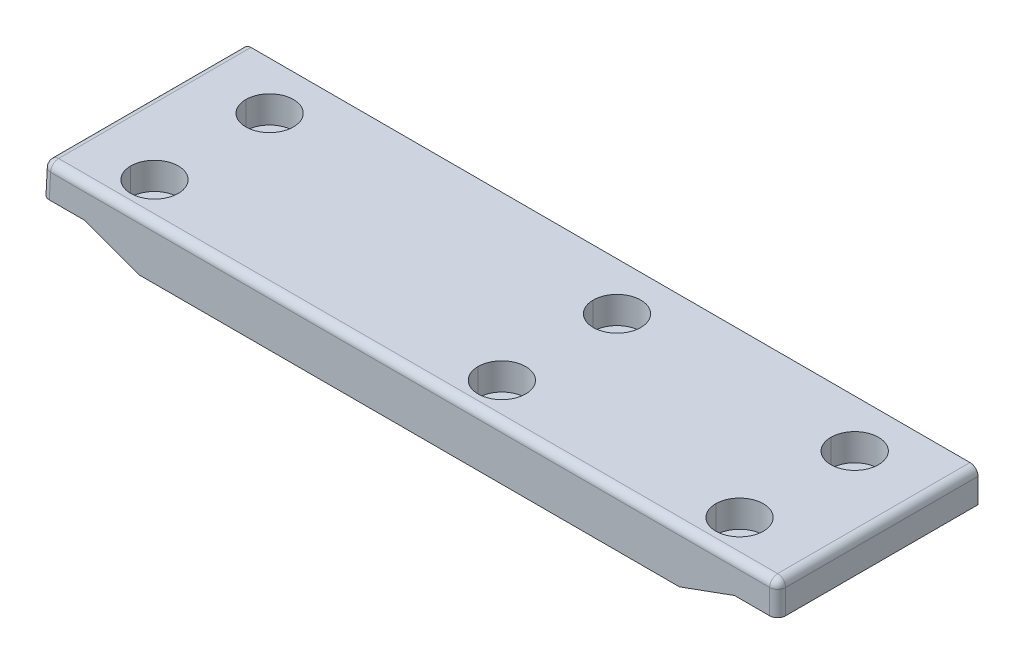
ISO-10303-21;
HEADER;
FILE_DESCRIPTION(('STEP AP214'),'2;1');
FILE_NAME('part.step','',(''),(''),'','','');
FILE_SCHEMA(('AUTOMOTIVE_DESIGN { 1 0 10303 214 1 1 1 1 }'));
ENDSEC;
DATA;
#1=APPLICATION_CONTEXT('core data for automotive mechanical design processes');
#2=APPLICATION_PROTOCOL_DEFINITION('international standard','automotive_design',2000,#1);
#3=PRODUCT_CONTEXT('',#1,'mechanical');
#4=PRODUCT('Part','Part','',(#3));
#5=PRODUCT_RELATED_PRODUCT_CATEGORY('part','',(#4));
#6=PRODUCT_DEFINITION_FORMATION('','',#4);
#7=PRODUCT_DEFINITION_CONTEXT('part definition',#1,'design');
#8=PRODUCT_DEFINITION('design','',#6,#7);
#9=PRODUCT_DEFINITION_SHAPE('','',#8);
#10=(LENGTH_UNIT() NAMED_UNIT(*) SI_UNIT(.MILLI.,.METRE.));
#11=(NAMED_UNIT(*) PLANE_ANGLE_UNIT() SI_UNIT($,.RADIAN.));
#12=(NAMED_UNIT(*) SI_UNIT($,.STERADIAN.) SOLID_ANGLE_UNIT());
#13=UNCERTAINTY_MEASURE_WITH_UNIT(LENGTH_MEASURE(1.E-05),#10,'distance_accuracy_value','');
#14=(GEOMETRIC_REPRESENTATION_CONTEXT(3) GLOBAL_UNCERTAINTY_ASSIGNED_CONTEXT((#13)) GLOBAL_UNIT_ASSIGNED_CONTEXT((#10,
#11,#12)) REPRESENTATION_CONTEXT('',''));
#15=CARTESIAN_POINT('',(0.,0.,0.));
#16=DIRECTION('',(0.,0.,1.));
#17=DIRECTION('',(1.,0.,0.));
#18=AXIS2_PLACEMENT_3D('',#15,#16,#17);
#19=CARTESIAN_POINT('',(2.68106962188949,72.0861397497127,38.4));
#20=DIRECTION('',(-0.0523359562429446,-0.998629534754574,0.));
#21=DIRECTION('',(0.998629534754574,-0.0523359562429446,0.));
#22=AXIS2_PLACEMENT_3D('',#19,#20,#21);
#23=CYLINDRICAL_SURFACE('',#22,1.6);
#24=CARTESIAN_POINT('',(1.8589938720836,56.4,38.4));
#25=DIRECTION('',(-0.0523359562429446,-0.998629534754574,0.));
#26=DIRECTION('',(-0.998629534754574,0.0523359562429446,0.));
#27=AXIS2_PLACEMENT_3D('',#24,#25,#26);
#28=CIRCLE('',#27,1.6);
#29=CARTESIAN_POINT('',(1.8589938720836,56.4,40.));
#30=VERTEX_POINT('',#29);
#31=CARTESIAN_POINT('',(0.261186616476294,56.4837375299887,38.4));
#32=VERTEX_POINT('',#31);
#33=EDGE_CURVE('E11',#30,#32,#28,.T.);
#34=ORIENTED_EDGE('',*,*,#33,.T.);
#35=DIRECTION('',(0.0523359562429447,0.998629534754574,0.));
#36=VECTOR('',#35,1.);
#37=CARTESIAN_POINT('',(0.,51.5,38.4));
#38=LINE('',#37,#36);
#39=CARTESIAN_POINT('',(0.,51.5,38.4));
#40=VERTEX_POINT('',#39);
#41=EDGE_CURVE('E288',#40,#32,#38,.T.);
#42=ORIENTED_EDGE('',*,*,#41,.F.);
#43=CARTESIAN_POINT('',(1.60219575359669,51.5,40.));
#44=CARTESIAN_POINT('',(0.663651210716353,51.5,40.));
#45=CARTESIAN_POINT('',(0.,51.5,39.3372583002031));
#46=CARTESIAN_POINT('',(0.,51.5,38.4));
#47=(BOUNDED_CURVE() B_SPLINE_CURVE(3,(#43,#44,#45,#46),.UNSPECIFIED.,.F.,
.F.) B_SPLINE_CURVE_WITH_KNOTS((4,4),(4.7123889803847,6.28318530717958),
.UNSPECIFIED.) CURVE() GEOMETRIC_REPRESENTATION_ITEM() RATIONAL_B_SPLINE_CURVE((1.,
0.804737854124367,0.804737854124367,1.)) REPRESENTATION_ITEM(''));
#48=CARTESIAN_POINT('',(1.60219575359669,51.5,40.));
#49=VERTEX_POINT('',#48);
#50=EDGE_CURVE('E148',#49,#40,#47,.T.);
#51=ORIENTED_EDGE('',*,*,#50,.F.);
#52=DIRECTION('',(-0.0523359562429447,-0.998629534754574,0.));
#53=VECTOR('',#52,1.);
#54=CARTESIAN_POINT('',(2.68106962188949,72.0861397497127,40.));
#55=LINE('',#54,#53);
#56=EDGE_CURVE('E282',#30,#49,#55,.T.);
#57=ORIENTED_EDGE('',*,*,#56,.F.);
#58=EDGE_LOOP('',(#34,#42,#51,#57));
#59=FACE_BOUND('',#58,.T.);
#60=ADVANCED_FACE('F16',(#59),#23,.T.);
#61=CARTESIAN_POINT('',(1.8589938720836,56.4,38.4));
#62=DIRECTION('',(0.,0.,1.));
#63=DIRECTION('',(1.,0.,0.));
#64=AXIS2_PLACEMENT_3D('',#61,#62,#63);
#65=SPHERICAL_SURFACE('',#64,1.6);
#66=CARTESIAN_POINT('',(1.8589938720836,56.4,38.4));
#67=DIRECTION('',(-1.,0.,0.));
#68=DIRECTION('',(0.,-1.,0.));
#69=AXIS2_PLACEMENT_3D('',#66,#67,#68);
#70=CIRCLE('',#69,1.6);
#71=CARTESIAN_POINT('',(1.85899387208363,58.,38.4));
#72=VERTEX_POINT('',#71);
#73=EDGE_CURVE('E25',#30,#72,#70,.T.);
#74=ORIENTED_EDGE('',*,*,#73,.T.);
#75=CARTESIAN_POINT('',(1.85899387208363,56.4,38.4));
#76=DIRECTION('',(0.,0.,1.));
#77=DIRECTION('',(0.,-1.,0.));
#78=AXIS2_PLACEMENT_3D('',#75,#76,#77);
#79=CIRCLE('',#78,1.6);
#80=EDGE_CURVE('E439',#72,#32,#79,.T.);
#81=ORIENTED_EDGE('',*,*,#80,.T.);
#82=ORIENTED_EDGE('',*,*,#33,.F.);
#83=EDGE_LOOP('',(#74,#81,#82));
#84=FACE_BOUND('',#83,.T.);
#85=ADVANCED_FACE('F832',(#84),#65,.T.);
#86=CARTESIAN_POINT('',(80.6492607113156,56.4,38.4));
#87=DIRECTION('',(-1.,0.,0.));
#88=DIRECTION('',(0.,-1.,0.));
#89=AXIS2_PLACEMENT_3D('',#86,#87,#88);
#90=CYLINDRICAL_SURFACE('',#89,1.6);
#91=CARTESIAN_POINT('',(145.4,56.4,38.4));
#92=DIRECTION('',(-1.,0.,0.));
#93=DIRECTION('',(0.,1.,0.));
#94=AXIS2_PLACEMENT_3D('',#91,#92,#93);
#95=CIRCLE('',#94,1.6);
#96=CARTESIAN_POINT('',(145.4,56.4,40.));
#97=VERTEX_POINT('',#96);
#98=CARTESIAN_POINT('',(145.4,58.,38.4));
#99=VERTEX_POINT('',#98);
#100=EDGE_CURVE('E19',#97,#99,#95,.T.);
#101=ORIENTED_EDGE('',*,*,#100,.T.);
#102=DIRECTION('',(1.,0.,0.));
#103=VECTOR('',#102,1.);
#104=CARTESIAN_POINT('',(147.,58.,38.4));
#105=LINE('',#104,#103);
#106=EDGE_CURVE('E302',#72,#99,#105,.T.);
#107=ORIENTED_EDGE('',*,*,#106,.F.);
#108=ORIENTED_EDGE('',*,*,#73,.F.);
#109=DIRECTION('',(-1.,0.,0.));
#110=VECTOR('',#109,1.);
#111=CARTESIAN_POINT('',(80.6492607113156,56.4,40.));
#112=LINE('',#111,#110);
#113=EDGE_CURVE('E189',#97,#30,#112,.T.);
#114=ORIENTED_EDGE('',*,*,#113,.F.);
#115=EDGE_LOOP('',(#101,#107,#108,#114));
#116=FACE_BOUND('',#115,.T.);
#117=ADVANCED_FACE('F837',(#116),#90,.T.);
#118=CARTESIAN_POINT('',(1.85899387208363,56.4,0.));
#119=DIRECTION('',(0.,0.,1.));
#120=DIRECTION('',(0.,-1.,0.));
#121=AXIS2_PLACEMENT_3D('',#118,#119,#120);
#122=CYLINDRICAL_SURFACE('',#121,1.6);
#123=CARTESIAN_POINT('',(1.85899387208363,56.4,0.));
#124=DIRECTION('',(0.,0.,-1.));
#125=DIRECTION('',(0.,-1.,0.));
#126=AXIS2_PLACEMENT_3D('',#123,#124,#125);
#127=CIRCLE('',#126,1.6);
#128=CARTESIAN_POINT('',(0.261186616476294,56.4837375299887,0.));
#129=VERTEX_POINT('',#128);
#130=CARTESIAN_POINT('',(1.8589938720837,58.,0.));
#131=VERTEX_POINT('',#130);
#132=EDGE_CURVE('E186',#129,#131,#127,.T.);
#133=ORIENTED_EDGE('',*,*,#132,.F.);
#134=DIRECTION('',(0.,0.,-1.));
#135=VECTOR('',#134,1.);
#136=CARTESIAN_POINT('',(0.261186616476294,56.4837375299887,0.));
#137=LINE('',#136,#135);
#138=EDGE_CURVE('E292',#32,#129,#137,.T.);
#139=ORIENTED_EDGE('',*,*,#138,.F.);
#140=ORIENTED_EDGE('',*,*,#80,.F.);
#141=DIRECTION('',(0.,0.,1.));
#142=VECTOR('',#141,1.);
#143=CARTESIAN_POINT('',(1.85899387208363,58.,0.));
#144=LINE('',#143,#142);
#145=EDGE_CURVE('E326',#131,#72,#144,.T.);
#146=ORIENTED_EDGE('',*,*,#145,.F.);
#147=EDGE_LOOP('',(#133,#139,#140,#146));
#148=FACE_BOUND('',#147,.T.);
#149=ADVANCED_FACE('F845',(#148),#122,.T.);
#150=CARTESIAN_POINT('',(145.4,56.4,38.4));
#151=DIRECTION('',(0.,0.,1.));
#152=DIRECTION('',(1.,0.,0.));
#153=AXIS2_PLACEMENT_3D('',#150,#151,#152);
#154=SPHERICAL_SURFACE('',#153,1.6);
#155=CARTESIAN_POINT('',(145.4,56.4,38.4));
#156=DIRECTION('',(0.,1.,0.));
#157=DIRECTION('',(-1.,0.,0.));
#158=AXIS2_PLACEMENT_3D('',#155,#156,#157);
#159=CIRCLE('',#158,1.6);
#160=CARTESIAN_POINT('',(147.,56.4,38.4));
#161=VERTEX_POINT('',#160);
#162=EDGE_CURVE('E231',#97,#161,#159,.T.);
#163=ORIENTED_EDGE('',*,*,#162,.T.);
#164=CARTESIAN_POINT('',(145.4,56.4,38.4));
#165=DIRECTION('',(0.,0.,1.));
#166=DIRECTION('',(0.,-1.,0.));
#167=AXIS2_PLACEMENT_3D('',#164,#165,#166);
#168=CIRCLE('',#167,1.6);
#169=EDGE_CURVE('E175',#161,#99,#168,.T.);
#170=ORIENTED_EDGE('',*,*,#169,.T.);
#171=ORIENTED_EDGE('',*,*,#100,.F.);
#172=EDGE_LOOP('',(#163,#170,#171));
#173=FACE_BOUND('',#172,.T.);
#174=ADVANCED_FACE('F939',(#173),#154,.T.);
#175=CARTESIAN_POINT('',(145.4,68.,38.4));
#176=DIRECTION('',(0.,1.,0.));
#177=DIRECTION('',(-1.,0.,0.));
#178=AXIS2_PLACEMENT_3D('',#175,#176,#177);
#179=CYLINDRICAL_SURFACE('',#178,1.6);
#180=CARTESIAN_POINT('',(145.4,51.5,38.4));
#181=DIRECTION('',(0.,-1.,0.));
#182=DIRECTION('',(1.,0.,0.));
#183=AXIS2_PLACEMENT_3D('',#180,#181,#182);
#184=CIRCLE('',#183,1.6);
#185=CARTESIAN_POINT('',(147.,51.5,38.4));
#186=VERTEX_POINT('',#185);
#187=CARTESIAN_POINT('',(145.4,51.5,40.));
#188=VERTEX_POINT('',#187);
#189=EDGE_CURVE('E313',#186,#188,#184,.T.);
#190=ORIENTED_EDGE('',*,*,#189,.F.);
#191=DIRECTION('',(0.,-1.,0.));
#192=VECTOR('',#191,1.);
#193=CARTESIAN_POINT('',(147.,51.5,38.4));
#194=LINE('',#193,#192);
#195=EDGE_CURVE('E350',#161,#186,#194,.T.);
#196=ORIENTED_EDGE('',*,*,#195,.F.);
#197=ORIENTED_EDGE('',*,*,#162,.F.);
#198=DIRECTION('',(0.,1.,0.));
#199=VECTOR('',#198,1.);
#200=CARTESIAN_POINT('',(145.4,68.,40.));
#201=LINE('',#200,#199);
#202=EDGE_CURVE('E277',#188,#97,#201,.T.);
#203=ORIENTED_EDGE('',*,*,#202,.F.);
#204=EDGE_LOOP('',(#190,#196,#197,#203));
#205=FACE_BOUND('',#204,.T.);
#206=ADVANCED_FACE('F936',(#205),#179,.T.);
#207=CARTESIAN_POINT('',(145.4,56.4,0.));
#208=DIRECTION('',(0.,0.,1.));
#209=DIRECTION('',(0.,-1.,0.));
#210=AXIS2_PLACEMENT_3D('',#207,#208,#209);
#211=CYLINDRICAL_SURFACE('',#210,1.6);
#212=CARTESIAN_POINT('',(145.4,56.4,0.));
#213=DIRECTION('',(0.,0.,-1.));
#214=DIRECTION('',(0.,-1.,0.));
#215=AXIS2_PLACEMENT_3D('',#212,#213,#214);
#216=CIRCLE('',#215,1.6);
#217=CARTESIAN_POINT('',(145.4,58.,0.));
#218=VERTEX_POINT('',#217);
#219=CARTESIAN_POINT('',(147.,56.4,0.));
#220=VERTEX_POINT('',#219);
#221=EDGE_CURVE('E147',#218,#220,#216,.T.);
#222=ORIENTED_EDGE('',*,*,#221,.F.);
#223=DIRECTION('',(0.,0.,-1.));
#224=VECTOR('',#223,1.);
#225=CARTESIAN_POINT('',(145.4,58.,0.));
#226=LINE('',#225,#224);
#227=EDGE_CURVE('E312',#99,#218,#226,.T.);
#228=ORIENTED_EDGE('',*,*,#227,.F.);
#229=ORIENTED_EDGE('',*,*,#169,.F.);
#230=DIRECTION('',(0.,0.,1.));
#231=VECTOR('',#230,1.);
#232=CARTESIAN_POINT('',(147.,56.4,0.));
#233=LINE('',#232,#231);
#234=EDGE_CURVE('E345',#220,#161,#233,.T.);
#235=ORIENTED_EDGE('',*,*,#234,.F.);
#236=EDGE_LOOP('',(#222,#228,#229,#235));
#237=FACE_BOUND('',#236,.T.);
#238=ADVANCED_FACE('F853',(#237),#211,.T.);
#239=CARTESIAN_POINT('',(131.9,2.59999999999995,9.517));
#240=DIRECTION('',(0.,1.,0.));
#241=DIRECTION('',(-1.,0.,0.));
#242=AXIS2_PLACEMENT_3D('',#239,#240,#241);
#243=CYLINDRICAL_SURFACE('',#242,2.625);
#244=DIRECTION('',(0.,1.,0.));
#245=VECTOR('',#244,1.);
#246=CARTESIAN_POINT('',(134.525,2.59999999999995,9.517));
#247=LINE('',#246,#245);
#248=CARTESIAN_POINT('',(134.525,50.0932879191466,9.517));
#249=VERTEX_POINT('',#248);
#250=CARTESIAN_POINT('',(134.525,52.6,9.517));
#251=VERTEX_POINT('',#250);
#252=EDGE_CURVE('E663',#249,#251,#247,.T.);
#253=ORIENTED_EDGE('',*,*,#252,.F.);
#254=CARTESIAN_POINT('',(134.525,50.0932879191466,9.517));
#255=CARTESIAN_POINT('',(134.525,50.0932879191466,14.767));
#256=CARTESIAN_POINT('',(129.275,48.1824441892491,14.767));
#257=CARTESIAN_POINT('',(129.275,48.1824441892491,9.517));
#258=(BOUNDED_CURVE() B_SPLINE_CURVE(3,(#254,#255,#256,#257),.UNSPECIFIED.,.F.,
.F.) B_SPLINE_CURVE_WITH_KNOTS((4,4),(0.,3.1415926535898),
.UNSPECIFIED.) CURVE() GEOMETRIC_REPRESENTATION_ITEM() RATIONAL_B_SPLINE_CURVE((1.,
0.333333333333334,0.333333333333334,1.)) REPRESENTATION_ITEM(''));
#259=CARTESIAN_POINT('',(129.275,48.1824441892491,9.517));
#260=VERTEX_POINT('',#259);
#261=EDGE_CURVE('E374',#249,#260,#258,.T.);
#262=ORIENTED_EDGE('',*,*,#261,.T.);
#263=DIRECTION('',(0.,1.,0.));
#264=VECTOR('',#263,1.);
#265=CARTESIAN_POINT('',(129.275,2.59999999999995,9.517));
#266=LINE('',#265,#264);
#267=CARTESIAN_POINT('',(129.275,52.6,9.517));
#268=VERTEX_POINT('',#267);
#269=EDGE_CURVE('E412',#260,#268,#266,.T.);
#270=ORIENTED_EDGE('',*,*,#269,.T.);
#271=CARTESIAN_POINT('',(131.9,52.6,9.517));
#272=DIRECTION('',(0.,1.,0.));
#273=DIRECTION('',(-1.,0.,0.));
#274=AXIS2_PLACEMENT_3D('',#271,#272,#273);
#275=CIRCLE('',#274,2.625);
#276=EDGE_CURVE('E194',#268,#251,#275,.T.);
#277=ORIENTED_EDGE('',*,*,#276,.T.);
#278=EDGE_LOOP('',(#253,#262,#270,#277));
#279=FACE_BOUND('',#278,.T.);
#280=ADVANCED_FACE('F890',(#279),#243,.F.);
#281=CARTESIAN_POINT('',(131.9,2.59999999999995,32.4989879));
#282=DIRECTION('',(0.,1.,0.));
#283=DIRECTION('',(-1.,0.,0.));
#284=AXIS2_PLACEMENT_3D('',#281,#282,#283);
#285=CYLINDRICAL_SURFACE('',#284,2.625);
#286=DIRECTION('',(0.,1.,0.));
#287=VECTOR('',#286,1.);
#288=CARTESIAN_POINT('',(134.525,2.59999999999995,32.4989879));
#289=LINE('',#288,#287);
#290=CARTESIAN_POINT('',(134.525,50.0932879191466,32.4989879));
#291=VERTEX_POINT('',#290);
#292=CARTESIAN_POINT('',(134.525,52.6,32.4989879));
#293=VERTEX_POINT('',#292);
#294=EDGE_CURVE('E417',#291,#293,#289,.T.);
#295=ORIENTED_EDGE('',*,*,#294,.F.);
#296=CARTESIAN_POINT('',(134.525,50.0932879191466,32.4989879));
#297=CARTESIAN_POINT('',(134.525,50.0932879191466,37.7489879));
#298=CARTESIAN_POINT('',(129.275,48.1824441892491,37.7489879));
#299=CARTESIAN_POINT('',(129.275,48.1824441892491,32.4989879));
#300=(BOUNDED_CURVE() B_SPLINE_CURVE(3,(#296,#297,#298,#299),.UNSPECIFIED.,.F.,
.F.) B_SPLINE_CURVE_WITH_KNOTS((4,4),(0.,3.1415926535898),
.UNSPECIFIED.) CURVE() GEOMETRIC_REPRESENTATION_ITEM() RATIONAL_B_SPLINE_CURVE((1.,
0.333333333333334,0.333333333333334,1.)) REPRESENTATION_ITEM(''));
#301=CARTESIAN_POINT('',(129.275,48.1824441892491,32.4989879));
#302=VERTEX_POINT('',#301);
#303=EDGE_CURVE('E382',#291,#302,#300,.T.);
#304=ORIENTED_EDGE('',*,*,#303,.T.);
#305=DIRECTION('',(0.,1.,0.));
#306=VECTOR('',#305,1.);
#307=CARTESIAN_POINT('',(129.275,2.59999999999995,32.4989879));
#308=LINE('',#307,#306);
#309=CARTESIAN_POINT('',(129.275,52.6,32.4989879));
#310=VERTEX_POINT('',#309);
#311=EDGE_CURVE('E436',#302,#310,#308,.T.);
#312=ORIENTED_EDGE('',*,*,#311,.T.);
#313=CARTESIAN_POINT('',(131.9,52.6,32.4989879));
#314=DIRECTION('',(0.,1.,0.));
#315=DIRECTION('',(-1.,0.,0.));
#316=AXIS2_PLACEMENT_3D('',#313,#314,#315);
#317=CIRCLE('',#316,2.625);
#318=EDGE_CURVE('E355',#310,#293,#317,.T.);
#319=ORIENTED_EDGE('',*,*,#318,.T.);
#320=EDGE_LOOP('',(#295,#304,#312,#319));
#321=FACE_BOUND('',#320,.T.);
#322=ADVANCED_FACE('F887',(#321),#285,.F.);
#323=CARTESIAN_POINT('',(84.45,2.59999999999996,9.517));
#324=DIRECTION('',(0.,1.,0.));
#325=DIRECTION('',(-1.,0.,0.));
#326=AXIS2_PLACEMENT_3D('',#323,#324,#325);
#327=CYLINDRICAL_SURFACE('',#326,2.625);
#328=DIRECTION('',(0.,1.,0.));
#329=VECTOR('',#328,1.);
#330=CARTESIAN_POINT('',(87.075,2.59999999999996,9.517));
#331=LINE('',#330,#329);
#332=CARTESIAN_POINT('',(87.075,47.5,9.517));
#333=VERTEX_POINT('',#332);
#334=CARTESIAN_POINT('',(87.075,52.6,9.517));
#335=VERTEX_POINT('',#334);
#336=EDGE_CURVE('E444',#333,#335,#331,.T.);
#337=ORIENTED_EDGE('',*,*,#336,.F.);
#338=CARTESIAN_POINT('',(84.45,47.5,9.517));
#339=DIRECTION('',(0.,-1.,0.));
#340=DIRECTION('',(1.,0.,0.));
#341=AXIS2_PLACEMENT_3D('',#338,#339,#340);
#342=CIRCLE('',#341,2.625);
#343=CARTESIAN_POINT('',(81.825,47.5,9.517));
#344=VERTEX_POINT('',#343);
#345=EDGE_CURVE('E237',#333,#344,#342,.T.);
#346=ORIENTED_EDGE('',*,*,#345,.T.);
#347=DIRECTION('',(0.,1.,0.));
#348=VECTOR('',#347,1.);
#349=CARTESIAN_POINT('',(81.825,2.59999999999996,9.517));
#350=LINE('',#349,#348);
#351=CARTESIAN_POINT('',(81.825,52.6,9.517));
#352=VERTEX_POINT('',#351);
#353=EDGE_CURVE('E450',#344,#352,#350,.T.);
#354=ORIENTED_EDGE('',*,*,#353,.T.);
#355=CARTESIAN_POINT('',(84.45,52.6,9.517));
#356=DIRECTION('',(0.,1.,0.));
#357=DIRECTION('',(-1.,0.,0.));
#358=AXIS2_PLACEMENT_3D('',#355,#356,#357);
#359=CIRCLE('',#358,2.625);
#360=EDGE_CURVE('E211',#352,#335,#359,.T.);
#361=ORIENTED_EDGE('',*,*,#360,.T.);
#362=EDGE_LOOP('',(#337,#346,#354,#361));
#363=FACE_BOUND('',#362,.T.);
#364=ADVANCED_FACE('F889',(#363),#327,.F.);
#365=CARTESIAN_POINT('',(84.45,2.59999999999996,32.4989879));
#366=DIRECTION('',(0.,1.,0.));
#367=DIRECTION('',(-1.,0.,0.));
#368=AXIS2_PLACEMENT_3D('',#365,#366,#367);
#369=CYLINDRICAL_SURFACE('',#368,2.625);
#370=DIRECTION('',(0.,1.,0.));
#371=VECTOR('',#370,1.);
#372=CARTESIAN_POINT('',(87.075,2.59999999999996,32.4989879));
#373=LINE('',#372,#371);
#374=CARTESIAN_POINT('',(87.075,47.5,32.4989879));
#375=VERTEX_POINT('',#374);
#376=CARTESIAN_POINT('',(87.075,52.6,32.4989879));
#377=VERTEX_POINT('',#376);
#378=EDGE_CURVE('E424',#375,#377,#373,.T.);
#379=ORIENTED_EDGE('',*,*,#378,.F.);
#380=CARTESIAN_POINT('',(84.45,47.5,32.4989879));
#381=DIRECTION('',(0.,-1.,0.));
#382=DIRECTION('',(1.,0.,0.));
#383=AXIS2_PLACEMENT_3D('',#380,#381,#382);
#384=CIRCLE('',#383,2.625);
#385=CARTESIAN_POINT('',(81.825,47.5,32.4989879));
#386=VERTEX_POINT('',#385);
#387=EDGE_CURVE('E171',#375,#386,#384,.T.);
#388=ORIENTED_EDGE('',*,*,#387,.T.);
#389=DIRECTION('',(0.,1.,0.));
#390=VECTOR('',#389,1.);
#391=CARTESIAN_POINT('',(81.825,2.59999999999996,32.4989879));
#392=LINE('',#391,#390);
#393=CARTESIAN_POINT('',(81.825,52.6,32.4989879));
#394=VERTEX_POINT('',#393);
#395=EDGE_CURVE('E456',#386,#394,#392,.T.);
#396=ORIENTED_EDGE('',*,*,#395,.T.);
#397=CARTESIAN_POINT('',(84.45,52.6,32.4989879));
#398=DIRECTION('',(0.,1.,0.));
#399=DIRECTION('',(-1.,0.,0.));
#400=AXIS2_PLACEMENT_3D('',#397,#398,#399);
#401=CIRCLE('',#400,2.625);
#402=EDGE_CURVE('E200',#394,#377,#401,.T.);
#403=ORIENTED_EDGE('',*,*,#402,.T.);
#404=EDGE_LOOP('',(#379,#388,#396,#403));
#405=FACE_BOUND('',#404,.T.);
#406=ADVANCED_FACE('F929',(#405),#369,.F.);
#407=CARTESIAN_POINT('',(15.1,2.6,32.4989879));
#408=DIRECTION('',(0.,1.,0.));
#409=DIRECTION('',(-1.,0.,0.));
#410=AXIS2_PLACEMENT_3D('',#407,#408,#409);
#411=CYLINDRICAL_SURFACE('',#410,2.625);
#412=DIRECTION('',(0.,1.,0.));
#413=VECTOR('',#412,1.);
#414=CARTESIAN_POINT('',(17.725,2.6,32.4989879));
#415=LINE('',#414,#413);
#416=CARTESIAN_POINT('',(17.725,48.1824441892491,32.4989879));
#417=VERTEX_POINT('',#416);
#418=CARTESIAN_POINT('',(17.725,52.6,32.4989879));
#419=VERTEX_POINT('',#418);
#420=EDGE_CURVE('E465',#417,#419,#415,.T.);
#421=ORIENTED_EDGE('',*,*,#420,.F.);
#422=CARTESIAN_POINT('',(17.725,48.1824441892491,32.4989879));
#423=CARTESIAN_POINT('',(17.725,48.1824441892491,37.7489879));
#424=CARTESIAN_POINT('',(12.475,50.0932879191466,37.7489879));
#425=CARTESIAN_POINT('',(12.475,50.0932879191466,32.4989879));
#426=(BOUNDED_CURVE() B_SPLINE_CURVE(3,(#422,#423,#424,#425),.UNSPECIFIED.,.F.,
.F.) B_SPLINE_CURVE_WITH_KNOTS((4,4),(3.1415926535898,6.28318530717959),
.UNSPECIFIED.) CURVE() GEOMETRIC_REPRESENTATION_ITEM() RATIONAL_B_SPLINE_CURVE((1.,
0.333333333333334,0.333333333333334,1.)) REPRESENTATION_ITEM(''));
#427=CARTESIAN_POINT('',(12.475,50.0932879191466,32.4989879));
#428=VERTEX_POINT('',#427);
#429=EDGE_CURVE('E161',#417,#428,#426,.T.);
#430=ORIENTED_EDGE('',*,*,#429,.T.);
#431=DIRECTION('',(0.,1.,0.));
#432=VECTOR('',#431,1.);
#433=CARTESIAN_POINT('',(12.475,2.6,32.4989879));
#434=LINE('',#433,#432);
#435=CARTESIAN_POINT('',(12.475,52.6,32.4989879));
#436=VERTEX_POINT('',#435);
#437=EDGE_CURVE('E476',#428,#436,#434,.T.);
#438=ORIENTED_EDGE('',*,*,#437,.T.);
#439=CARTESIAN_POINT('',(15.1,52.6,32.4989879));
#440=DIRECTION('',(0.,1.,0.));
#441=DIRECTION('',(-1.,0.,0.));
#442=AXIS2_PLACEMENT_3D('',#439,#440,#441);
#443=CIRCLE('',#442,2.625);
#444=EDGE_CURVE('E195',#436,#419,#443,.T.);
#445=ORIENTED_EDGE('',*,*,#444,.T.);
#446=EDGE_LOOP('',(#421,#430,#438,#445));
#447=FACE_BOUND('',#446,.T.);
#448=ADVANCED_FACE('F927',(#447),#411,.F.);
#449=CARTESIAN_POINT('',(15.1,2.6,9.517));
#450=DIRECTION('',(0.,1.,0.));
#451=DIRECTION('',(-1.,0.,0.));
#452=AXIS2_PLACEMENT_3D('',#449,#450,#451);
#453=CYLINDRICAL_SURFACE('',#452,2.625);
#454=DIRECTION('',(0.,1.,0.));
#455=VECTOR('',#454,1.);
#456=CARTESIAN_POINT('',(17.725,2.6,9.517));
#457=LINE('',#456,#455);
#458=CARTESIAN_POINT('',(17.725,48.1824441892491,9.517));
#459=VERTEX_POINT('',#458);
#460=CARTESIAN_POINT('',(17.725,52.6,9.517));
#461=VERTEX_POINT('',#460);
#462=EDGE_CURVE('E486',#459,#461,#457,.T.);
#463=ORIENTED_EDGE('',*,*,#462,.F.);
#464=CARTESIAN_POINT('',(17.725,48.1824441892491,9.517));
#465=CARTESIAN_POINT('',(17.725,48.1824441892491,14.767));
#466=CARTESIAN_POINT('',(12.475,50.0932879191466,14.767));
#467=CARTESIAN_POINT('',(12.475,50.0932879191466,9.517));
#468=(BOUNDED_CURVE() B_SPLINE_CURVE(3,(#464,#465,#466,#467),.UNSPECIFIED.,.F.,
.F.) B_SPLINE_CURVE_WITH_KNOTS((4,4),(3.1415926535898,6.28318530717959),
.UNSPECIFIED.) CURVE() GEOMETRIC_REPRESENTATION_ITEM() RATIONAL_B_SPLINE_CURVE((1.,
0.333333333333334,0.333333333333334,1.)) REPRESENTATION_ITEM(''));
#469=CARTESIAN_POINT('',(12.475,50.0932879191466,9.517));
#470=VERTEX_POINT('',#469);
#471=EDGE_CURVE('E179',#459,#470,#468,.T.);
#472=ORIENTED_EDGE('',*,*,#471,.T.);
#473=DIRECTION('',(0.,1.,0.));
#474=VECTOR('',#473,1.);
#475=CARTESIAN_POINT('',(12.475,2.6,9.517));
#476=LINE('',#475,#474);
#477=CARTESIAN_POINT('',(12.475,52.6,9.517));
#478=VERTEX_POINT('',#477);
#479=EDGE_CURVE('E497',#470,#478,#476,.T.);
#480=ORIENTED_EDGE('',*,*,#479,.T.);
#481=CARTESIAN_POINT('',(15.1,52.6,9.517));
#482=DIRECTION('',(0.,1.,0.));
#483=DIRECTION('',(-1.,0.,0.));
#484=AXIS2_PLACEMENT_3D('',#481,#482,#483);
#485=CIRCLE('',#484,2.625);
#486=EDGE_CURVE('E205',#478,#461,#485,.T.);
#487=ORIENTED_EDGE('',*,*,#486,.T.);
#488=EDGE_LOOP('',(#463,#472,#480,#487));
#489=FACE_BOUND('',#488,.T.);
#490=ADVANCED_FACE('F924',(#489),#453,.F.);
#491=CARTESIAN_POINT('',(84.45,52.6,9.517));
#492=DIRECTION('',(0.,1.,0.));
#493=DIRECTION('',(0.,0.,-1.));
#494=AXIS2_PLACEMENT_3D('',#491,#492,#493);
#495=PLANE('',#494);
#496=ORIENTED_EDGE('',*,*,#360,.F.);
#497=CARTESIAN_POINT('',(84.45,52.6,9.517));
#498=DIRECTION('',(0.,1.,0.));
#499=DIRECTION('',(-1.,0.,0.));
#500=AXIS2_PLACEMENT_3D('',#497,#498,#499);
#501=CIRCLE('',#500,2.625);
#502=EDGE_CURVE('E410',#335,#352,#501,.T.);
#503=ORIENTED_EDGE('',*,*,#502,.F.);
#504=EDGE_LOOP('',(#496,#503));
#505=FACE_BOUND('',#504,.T.);
#506=CARTESIAN_POINT('',(84.45,52.6,9.517));
#507=DIRECTION('',(0.,1.,0.));
#508=DIRECTION('',(-1.,0.,0.));
#509=AXIS2_PLACEMENT_3D('',#506,#507,#508);
#510=CIRCLE('',#509,4.75);
#511=CARTESIAN_POINT('',(79.7,52.6,9.517));
#512=VERTEX_POINT('',#511);
#513=CARTESIAN_POINT('',(89.2,52.6,9.517));
#514=VERTEX_POINT('',#513);
#515=EDGE_CURVE('E208',#512,#514,#510,.T.);
#516=ORIENTED_EDGE('',*,*,#515,.T.);
#517=CARTESIAN_POINT('',(84.45,52.6,9.517));
#518=DIRECTION('',(0.,1.,0.));
#519=DIRECTION('',(-1.,0.,0.));
#520=AXIS2_PLACEMENT_3D('',#517,#518,#519);
#521=CIRCLE('',#520,4.75);
#522=EDGE_CURVE('E504',#514,#512,#521,.T.);
#523=ORIENTED_EDGE('',*,*,#522,.T.);
#524=EDGE_LOOP('',(#516,#523));
#525=FACE_BOUND('',#524,.T.);
#526=ADVANCED_FACE('F922',(#505,#525),#495,.T.);
#527=CARTESIAN_POINT('',(84.45,52.6,9.517));
#528=DIRECTION('',(0.,1.,0.));
#529=DIRECTION('',(-1.,0.,0.));
#530=AXIS2_PLACEMENT_3D('',#527,#528,#529);
#531=CYLINDRICAL_SURFACE('',#530,4.75);
#532=DIRECTION('',(0.,1.,0.));
#533=VECTOR('',#532,1.);
#534=CARTESIAN_POINT('',(89.2,52.6,9.517));
#535=LINE('',#534,#533);
#536=CARTESIAN_POINT('',(89.2,58.,9.517));
#537=VERTEX_POINT('',#536);
#538=EDGE_CURVE('E516',#514,#537,#535,.T.);
#539=ORIENTED_EDGE('',*,*,#538,.F.);
#540=ORIENTED_EDGE('',*,*,#515,.F.);
#541=DIRECTION('',(0.,1.,0.));
#542=VECTOR('',#541,1.);
#543=CARTESIAN_POINT('',(79.7,52.6,9.517));
#544=LINE('',#543,#542);
#545=CARTESIAN_POINT('',(79.7,58.,9.517));
#546=VERTEX_POINT('',#545);
#547=EDGE_CURVE('E527',#512,#546,#544,.T.);
#548=ORIENTED_EDGE('',*,*,#547,.T.);
#549=CARTESIAN_POINT('',(84.45,58.,9.517));
#550=DIRECTION('',(0.,1.,0.));
#551=DIRECTION('',(-1.,0.,0.));
#552=AXIS2_PLACEMENT_3D('',#549,#550,#551);
#553=CIRCLE('',#552,4.75);
#554=EDGE_CURVE('E330',#546,#537,#553,.T.);
#555=ORIENTED_EDGE('',*,*,#554,.T.);
#556=EDGE_LOOP('',(#539,#540,#548,#555));
#557=FACE_BOUND('',#556,.T.);
#558=ADVANCED_FACE('F918',(#557),#531,.F.);
#559=CARTESIAN_POINT('',(15.1,52.6,9.517));
#560=DIRECTION('',(0.,1.,0.));
#561=DIRECTION('',(0.,0.,-1.));
#562=AXIS2_PLACEMENT_3D('',#559,#560,#561);
#563=PLANE('',#562);
#564=ORIENTED_EDGE('',*,*,#486,.F.);
#565=CARTESIAN_POINT('',(15.1,52.6,9.517));
#566=DIRECTION('',(0.,1.,0.));
#567=DIRECTION('',(-1.,0.,0.));
#568=AXIS2_PLACEMENT_3D('',#565,#566,#567);
#569=CIRCLE('',#568,2.625);
#570=EDGE_CURVE('E493',#461,#478,#569,.T.);
#571=ORIENTED_EDGE('',*,*,#570,.F.);
#572=EDGE_LOOP('',(#564,#571));
#573=FACE_BOUND('',#572,.T.);
#574=CARTESIAN_POINT('',(15.1,52.6,9.517));
#575=DIRECTION('',(0.,1.,0.));
#576=DIRECTION('',(-1.,0.,0.));
#577=AXIS2_PLACEMENT_3D('',#574,#575,#576);
#578=CIRCLE('',#577,4.75);
#579=CARTESIAN_POINT('',(10.35,52.6,9.517));
#580=VERTEX_POINT('',#579);
#581=CARTESIAN_POINT('',(19.85,52.6,9.517));
#582=VERTEX_POINT('',#581);
#583=EDGE_CURVE('E204',#580,#582,#578,.T.);
#584=ORIENTED_EDGE('',*,*,#583,.T.);
#585=CARTESIAN_POINT('',(15.1,52.6,9.517));
#586=DIRECTION('',(0.,1.,0.));
#587=DIRECTION('',(-1.,0.,0.));
#588=AXIS2_PLACEMENT_3D('',#585,#586,#587);
#589=CIRCLE('',#588,4.75);
#590=EDGE_CURVE('E531',#582,#580,#589,.T.);
#591=ORIENTED_EDGE('',*,*,#590,.T.);
#592=EDGE_LOOP('',(#584,#591));
#593=FACE_BOUND('',#592,.T.);
#594=ADVANCED_FACE('F914',(#573,#593),#563,.T.);
#595=CARTESIAN_POINT('',(15.1,52.6,9.517));
#596=DIRECTION('',(0.,1.,0.));
#597=DIRECTION('',(-1.,0.,0.));
#598=AXIS2_PLACEMENT_3D('',#595,#596,#597);
#599=CYLINDRICAL_SURFACE('',#598,4.75);
#600=DIRECTION('',(0.,1.,0.));
#601=VECTOR('',#600,1.);
#602=CARTESIAN_POINT('',(19.85,52.6,9.517));
#603=LINE('',#602,#601);
#604=CARTESIAN_POINT('',(19.85,58.,9.517));
#605=VERTEX_POINT('',#604);
#606=EDGE_CURVE('E540',#582,#605,#603,.T.);
#607=ORIENTED_EDGE('',*,*,#606,.F.);
#608=ORIENTED_EDGE('',*,*,#583,.F.);
#609=DIRECTION('',(0.,1.,0.));
#610=VECTOR('',#609,1.);
#611=CARTESIAN_POINT('',(10.35,52.6,9.517));
#612=LINE('',#611,#610);
#613=CARTESIAN_POINT('',(10.35,58.,9.517));
#614=VERTEX_POINT('',#613);
#615=EDGE_CURVE('E551',#580,#614,#612,.T.);
#616=ORIENTED_EDGE('',*,*,#615,.T.);
#617=CARTESIAN_POINT('',(15.1,58.,9.517));
#618=DIRECTION('',(0.,1.,0.));
#619=DIRECTION('',(-1.,0.,0.));
#620=AXIS2_PLACEMENT_3D('',#617,#618,#619);
#621=CIRCLE('',#620,4.75);
#622=EDGE_CURVE('E338',#614,#605,#621,.T.);
#623=ORIENTED_EDGE('',*,*,#622,.T.);
#624=EDGE_LOOP('',(#607,#608,#616,#623));
#625=FACE_BOUND('',#624,.T.);
#626=ADVANCED_FACE('F910',(#625),#599,.F.);
#627=CARTESIAN_POINT('',(84.45,52.6,32.4989879));
#628=DIRECTION('',(0.,1.,0.));
#629=DIRECTION('',(0.,0.,-1.));
#630=AXIS2_PLACEMENT_3D('',#627,#628,#629);
#631=PLANE('',#630);
#632=ORIENTED_EDGE('',*,*,#402,.F.);
#633=CARTESIAN_POINT('',(84.45,52.6,32.4989879));
#634=DIRECTION('',(0.,1.,0.));
#635=DIRECTION('',(-1.,0.,0.));
#636=AXIS2_PLACEMENT_3D('',#633,#634,#635);
#637=CIRCLE('',#636,2.625);
#638=EDGE_CURVE('E428',#377,#394,#637,.T.);
#639=ORIENTED_EDGE('',*,*,#638,.F.);
#640=EDGE_LOOP('',(#632,#639));
#641=FACE_BOUND('',#640,.T.);
#642=CARTESIAN_POINT('',(84.45,52.6,32.4989879));
#643=DIRECTION('',(0.,1.,0.));
#644=DIRECTION('',(-1.,0.,0.));
#645=AXIS2_PLACEMENT_3D('',#642,#643,#644);
#646=CIRCLE('',#645,4.75);
#647=CARTESIAN_POINT('',(79.7,52.6,32.4989879));
#648=VERTEX_POINT('',#647);
#649=CARTESIAN_POINT('',(89.2,52.6,32.4989879));
#650=VERTEX_POINT('',#649);
#651=EDGE_CURVE('E199',#648,#650,#646,.T.);
#652=ORIENTED_EDGE('',*,*,#651,.T.);
#653=CARTESIAN_POINT('',(84.45,52.6,32.4989879));
#654=DIRECTION('',(0.,1.,0.));
#655=DIRECTION('',(-1.,0.,0.));
#656=AXIS2_PLACEMENT_3D('',#653,#654,#655);
#657=CIRCLE('',#656,4.75);
#658=EDGE_CURVE('E558',#650,#648,#657,.T.);
#659=ORIENTED_EDGE('',*,*,#658,.T.);
#660=EDGE_LOOP('',(#652,#659));
#661=FACE_BOUND('',#660,.T.);
#662=ADVANCED_FACE('F906',(#641,#661),#631,.T.);
#663=CARTESIAN_POINT('',(84.45,52.6,32.4989879));
#664=DIRECTION('',(0.,1.,0.));
#665=DIRECTION('',(-1.,0.,0.));
#666=AXIS2_PLACEMENT_3D('',#663,#664,#665);
#667=CYLINDRICAL_SURFACE('',#666,4.75);
#668=DIRECTION('',(0.,1.,0.));
#669=VECTOR('',#668,1.);
#670=CARTESIAN_POINT('',(89.2,52.6,32.4989879));
#671=LINE('',#670,#669);
#672=CARTESIAN_POINT('',(89.2,58.,32.4989879));
#673=VERTEX_POINT('',#672);
#674=EDGE_CURVE('E562',#650,#673,#671,.T.);
#675=ORIENTED_EDGE('',*,*,#674,.F.);
#676=ORIENTED_EDGE('',*,*,#651,.F.);
#677=DIRECTION('',(0.,1.,0.));
#678=VECTOR('',#677,1.);
#679=CARTESIAN_POINT('',(79.7,52.6,32.4989879));
#680=LINE('',#679,#678);
#681=CARTESIAN_POINT('',(79.7,58.,32.4989879));
#682=VERTEX_POINT('',#681);
#683=EDGE_CURVE('E570',#648,#682,#680,.T.);
#684=ORIENTED_EDGE('',*,*,#683,.T.);
#685=CARTESIAN_POINT('',(84.45,58.,32.4989879));
#686=DIRECTION('',(0.,1.,0.));
#687=DIRECTION('',(-1.,0.,0.));
#688=AXIS2_PLACEMENT_3D('',#685,#686,#687);
#689=CIRCLE('',#688,4.75);
#690=EDGE_CURVE('E535',#682,#673,#689,.T.);
#691=ORIENTED_EDGE('',*,*,#690,.T.);
#692=EDGE_LOOP('',(#675,#676,#684,#691));
#693=FACE_BOUND('',#692,.T.);
#694=ADVANCED_FACE('F903',(#693),#667,.F.);
#695=CARTESIAN_POINT('',(131.9,52.6,9.517));
#696=DIRECTION('',(0.,1.,0.));
#697=DIRECTION('',(0.,0.,-1.));
#698=AXIS2_PLACEMENT_3D('',#695,#696,#697);
#699=PLANE('',#698);
#700=ORIENTED_EDGE('',*,*,#276,.F.);
#701=CARTESIAN_POINT('',(131.9,52.6,9.517));
#702=DIRECTION('',(0.,1.,0.));
#703=DIRECTION('',(-1.,0.,0.));
#704=AXIS2_PLACEMENT_3D('',#701,#702,#703);
#705=CIRCLE('',#704,2.625);
#706=EDGE_CURVE('E415',#251,#268,#705,.T.);
#707=ORIENTED_EDGE('',*,*,#706,.F.);
#708=EDGE_LOOP('',(#700,#707));
#709=FACE_BOUND('',#708,.T.);
#710=CARTESIAN_POINT('',(131.9,52.6,9.517));
#711=DIRECTION('',(0.,1.,0.));
#712=DIRECTION('',(-1.,0.,0.));
#713=AXIS2_PLACEMENT_3D('',#710,#711,#712);
#714=CIRCLE('',#713,4.75);
#715=CARTESIAN_POINT('',(127.15,52.6,9.517));
#716=VERTEX_POINT('',#715);
#717=CARTESIAN_POINT('',(136.65,52.6,9.517));
#718=VERTEX_POINT('',#717);
#719=EDGE_CURVE('E190',#716,#718,#714,.T.);
#720=ORIENTED_EDGE('',*,*,#719,.T.);
#721=CARTESIAN_POINT('',(131.9,52.6,9.517));
#722=DIRECTION('',(0.,1.,0.));
#723=DIRECTION('',(-1.,0.,0.));
#724=AXIS2_PLACEMENT_3D('',#721,#722,#723);
#725=CIRCLE('',#724,4.75);
#726=EDGE_CURVE('E574',#718,#716,#725,.T.);
#727=ORIENTED_EDGE('',*,*,#726,.T.);
#728=EDGE_LOOP('',(#720,#727));
#729=FACE_BOUND('',#728,.T.);
#730=ADVANCED_FACE('F691',(#709,#729),#699,.T.);
#731=CARTESIAN_POINT('',(131.9,52.6,9.517));
#732=DIRECTION('',(0.,1.,0.));
#733=DIRECTION('',(-1.,0.,0.));
#734=AXIS2_PLACEMENT_3D('',#731,#732,#733);
#735=CYLINDRICAL_SURFACE('',#734,4.75);
#736=DIRECTION('',(0.,1.,0.));
#737=VECTOR('',#736,1.);
#738=CARTESIAN_POINT('',(136.65,52.6,9.517));
#739=LINE('',#738,#737);
#740=CARTESIAN_POINT('',(136.65,58.,9.517));
#741=VERTEX_POINT('',#740);
#742=EDGE_CURVE('E578',#718,#741,#739,.T.);
#743=ORIENTED_EDGE('',*,*,#742,.F.);
#744=ORIENTED_EDGE('',*,*,#719,.F.);
#745=DIRECTION('',(0.,1.,0.));
#746=VECTOR('',#745,1.);
#747=CARTESIAN_POINT('',(127.15,52.6,9.517));
#748=LINE('',#747,#746);
#749=CARTESIAN_POINT('',(127.15,58.,9.517));
#750=VERTEX_POINT('',#749);
#751=EDGE_CURVE('E593',#716,#750,#748,.T.);
#752=ORIENTED_EDGE('',*,*,#751,.T.);
#753=CARTESIAN_POINT('',(131.9,58.,9.517));
#754=DIRECTION('',(0.,1.,0.));
#755=DIRECTION('',(-1.,0.,0.));
#756=AXIS2_PLACEMENT_3D('',#753,#754,#755);
#757=CIRCLE('',#756,4.75);
#758=EDGE_CURVE('E539',#750,#741,#757,.T.);
#759=ORIENTED_EDGE('',*,*,#758,.T.);
#760=EDGE_LOOP('',(#743,#744,#752,#759));
#761=FACE_BOUND('',#760,.T.);
#762=ADVANCED_FACE('F827',(#761),#735,.F.);
#763=CARTESIAN_POINT('',(15.1,52.6,32.4989879));
#764=DIRECTION('',(0.,1.,0.));
#765=DIRECTION('',(0.,0.,-1.));
#766=AXIS2_PLACEMENT_3D('',#763,#764,#765);
#767=PLANE('',#766);
#768=ORIENTED_EDGE('',*,*,#444,.F.);
#769=CARTESIAN_POINT('',(15.1,52.6,32.4989879));
#770=DIRECTION('',(0.,1.,0.));
#771=DIRECTION('',(-1.,0.,0.));
#772=AXIS2_PLACEMENT_3D('',#769,#770,#771);
#773=CIRCLE('',#772,2.625);
#774=EDGE_CURVE('E472',#419,#436,#773,.T.);
#775=ORIENTED_EDGE('',*,*,#774,.F.);
#776=EDGE_LOOP('',(#768,#775));
#777=FACE_BOUND('',#776,.T.);
#778=CARTESIAN_POINT('',(15.1,52.6,32.4989879));
#779=DIRECTION('',(0.,1.,0.));
#780=DIRECTION('',(-1.,0.,0.));
#781=AXIS2_PLACEMENT_3D('',#778,#779,#780);
#782=CIRCLE('',#781,4.75);
#783=CARTESIAN_POINT('',(10.35,52.6,32.4989879));
#784=VERTEX_POINT('',#783);
#785=CARTESIAN_POINT('',(19.85,52.6,32.4989879));
#786=VERTEX_POINT('',#785);
#787=EDGE_CURVE('E359',#784,#786,#782,.T.);
#788=ORIENTED_EDGE('',*,*,#787,.T.);
#789=CARTESIAN_POINT('',(15.1,52.6,32.4989879));
#790=DIRECTION('',(0.,1.,0.));
#791=DIRECTION('',(-1.,0.,0.));
#792=AXIS2_PLACEMENT_3D('',#789,#790,#791);
#793=CIRCLE('',#792,4.75);
#794=EDGE_CURVE('E596',#786,#784,#793,.T.);
#795=ORIENTED_EDGE('',*,*,#794,.T.);
#796=EDGE_LOOP('',(#788,#795));
#797=FACE_BOUND('',#796,.T.);
#798=ADVANCED_FACE('F816',(#777,#797),#767,.T.);
#799=CARTESIAN_POINT('',(15.1,52.6,32.4989879));
#800=DIRECTION('',(0.,1.,0.));
#801=DIRECTION('',(-1.,0.,0.));
#802=AXIS2_PLACEMENT_3D('',#799,#800,#801);
#803=CYLINDRICAL_SURFACE('',#802,4.75);
#804=DIRECTION('',(0.,1.,0.));
#805=VECTOR('',#804,1.);
#806=CARTESIAN_POINT('',(19.85,52.6,32.4989879));
#807=LINE('',#806,#805);
#808=CARTESIAN_POINT('',(19.85,58.,32.4989879));
#809=VERTEX_POINT('',#808);
#810=EDGE_CURVE('E600',#786,#809,#807,.T.);
#811=ORIENTED_EDGE('',*,*,#810,.F.);
#812=ORIENTED_EDGE('',*,*,#787,.F.);
#813=DIRECTION('',(0.,1.,0.));
#814=VECTOR('',#813,1.);
#815=CARTESIAN_POINT('',(10.35,52.6,32.4989879));
#816=LINE('',#815,#814);
#817=CARTESIAN_POINT('',(10.35,58.,32.4989879));
#818=VERTEX_POINT('',#817);
#819=EDGE_CURVE('E261',#784,#818,#816,.T.);
#820=ORIENTED_EDGE('',*,*,#819,.T.);
#821=CARTESIAN_POINT('',(15.1,58.,32.4989879));
#822=DIRECTION('',(0.,1.,0.));
#823=DIRECTION('',(-1.,0.,0.));
#824=AXIS2_PLACEMENT_3D('',#821,#822,#823);
#825=CIRCLE('',#824,4.75);
#826=EDGE_CURVE('E346',#818,#809,#825,.T.);
#827=ORIENTED_EDGE('',*,*,#826,.T.);
#828=EDGE_LOOP('',(#811,#812,#820,#827));
#829=FACE_BOUND('',#828,.T.);
#830=ADVANCED_FACE('F817',(#829),#803,.F.);
#831=CARTESIAN_POINT('',(131.9,52.6,32.4989879));
#832=DIRECTION('',(0.,1.,0.));
#833=DIRECTION('',(0.,0.,-1.));
#834=AXIS2_PLACEMENT_3D('',#831,#832,#833);
#835=PLANE('',#834);
#836=ORIENTED_EDGE('',*,*,#318,.F.);
#837=CARTESIAN_POINT('',(131.9,52.6,32.4989879));
#838=DIRECTION('',(0.,1.,0.));
#839=DIRECTION('',(-1.,0.,0.));
#840=AXIS2_PLACEMENT_3D('',#837,#838,#839);
#841=CIRCLE('',#840,2.625);
#842=EDGE_CURVE('E421',#293,#310,#841,.T.);
#843=ORIENTED_EDGE('',*,*,#842,.F.);
#844=EDGE_LOOP('',(#836,#843));
#845=FACE_BOUND('',#844,.T.);
#846=CARTESIAN_POINT('',(131.9,52.6,32.4989879));
#847=DIRECTION('',(0.,1.,0.));
#848=DIRECTION('',(-1.,0.,0.));
#849=AXIS2_PLACEMENT_3D('',#846,#847,#848);
#850=CIRCLE('',#849,4.75);
#851=CARTESIAN_POINT('',(127.15,52.6,32.4989879));
#852=VERTEX_POINT('',#851);
#853=CARTESIAN_POINT('',(136.65,52.6,32.4989879));
#854=VERTEX_POINT('',#853);
#855=EDGE_CURVE('E281',#852,#854,#850,.T.);
#856=ORIENTED_EDGE('',*,*,#855,.T.);
#857=CARTESIAN_POINT('',(131.9,52.6,32.4989879));
#858=DIRECTION('',(0.,1.,0.));
#859=DIRECTION('',(-1.,0.,0.));
#860=AXIS2_PLACEMENT_3D('',#857,#858,#859);
#861=CIRCLE('',#860,4.75);
#862=EDGE_CURVE('E264',#854,#852,#861,.T.);
#863=ORIENTED_EDGE('',*,*,#862,.T.);
#864=EDGE_LOOP('',(#856,#863));
#865=FACE_BOUND('',#864,.T.);
#866=ADVANCED_FACE('F649',(#845,#865),#835,.T.);
#867=CARTESIAN_POINT('',(131.9,52.6,32.4989879));
#868=DIRECTION('',(0.,1.,0.));
#869=DIRECTION('',(-1.,0.,0.));
#870=AXIS2_PLACEMENT_3D('',#867,#868,#869);
#871=CYLINDRICAL_SURFACE('',#870,4.75);
#872=DIRECTION('',(0.,1.,0.));
#873=VECTOR('',#872,1.);
#874=CARTESIAN_POINT('',(136.65,52.6,32.4989879));
#875=LINE('',#874,#873);
#876=CARTESIAN_POINT('',(136.65,58.,32.4989879));
#877=VERTEX_POINT('',#876);
#878=EDGE_CURVE('E268',#854,#877,#875,.T.);
#879=ORIENTED_EDGE('',*,*,#878,.F.);
#880=ORIENTED_EDGE('',*,*,#855,.F.);
#881=DIRECTION('',(0.,1.,0.));
#882=VECTOR('',#881,1.);
#883=CARTESIAN_POINT('',(127.15,52.6,32.4989879));
#884=LINE('',#883,#882);
#885=CARTESIAN_POINT('',(127.15,58.,32.4989879));
#886=VERTEX_POINT('',#885);
#887=EDGE_CURVE('E276',#852,#886,#884,.T.);
#888=ORIENTED_EDGE('',*,*,#887,.T.);
#889=CARTESIAN_POINT('',(131.9,58.,32.4989879));
#890=DIRECTION('',(0.,1.,0.));
#891=DIRECTION('',(-1.,0.,0.));
#892=AXIS2_PLACEMENT_3D('',#889,#890,#891);
#893=CIRCLE('',#892,4.75);
#894=EDGE_CURVE('E341',#886,#877,#893,.T.);
#895=ORIENTED_EDGE('',*,*,#894,.T.);
#896=EDGE_LOOP('',(#879,#880,#888,#895));
#897=FACE_BOUND('',#896,.T.);
#898=ADVANCED_FACE('F643',(#897),#871,.F.);
#899=CARTESIAN_POINT('',(80.6492607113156,68.,40.));
#900=DIRECTION('',(0.,0.,1.));
#901=DIRECTION('',(1.,0.,0.));
#902=AXIS2_PLACEMENT_3D('',#899,#900,#901);
#903=PLANE('',#902);
#904=ORIENTED_EDGE('',*,*,#113,.T.);
#905=ORIENTED_EDGE('',*,*,#56,.T.);
#906=DIRECTION('',(1.,0.,0.));
#907=VECTOR('',#906,1.);
#908=CARTESIAN_POINT('',(0.,51.5,40.));
#909=LINE('',#908,#907);
#910=CARTESIAN_POINT('',(8.61009032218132,51.5,40.));
#911=VERTEX_POINT('',#910);
#912=EDGE_CURVE('E510',#49,#911,#909,.T.);
#913=ORIENTED_EDGE('',*,*,#912,.T.);
#914=DIRECTION('',(0.939692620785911,-0.342020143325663,0.));
#915=VECTOR('',#914,1.);
#916=CARTESIAN_POINT('',(8.61009032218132,51.5,40.));
#917=LINE('',#916,#915);
#918=CARTESIAN_POINT('',(19.6,47.5,40.));
#919=VERTEX_POINT('',#918);
#920=EDGE_CURVE('E164',#911,#919,#917,.T.);
#921=ORIENTED_EDGE('',*,*,#920,.T.);
#922=DIRECTION('',(1.,0.,0.));
#923=VECTOR('',#922,1.);
#924=CARTESIAN_POINT('',(19.6,47.5,40.));
#925=LINE('',#924,#923);
#926=CARTESIAN_POINT('',(127.4,47.5,40.));
#927=VERTEX_POINT('',#926);
#928=EDGE_CURVE('E234',#919,#927,#925,.T.);
#929=ORIENTED_EDGE('',*,*,#928,.T.);
#930=DIRECTION('',(0.93969262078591,0.342020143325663,0.));
#931=VECTOR('',#930,1.);
#932=CARTESIAN_POINT('',(127.4,47.5,40.));
#933=LINE('',#932,#931);
#934=CARTESIAN_POINT('',(138.389909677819,51.5,40.));
#935=VERTEX_POINT('',#934);
#936=EDGE_CURVE('E308',#927,#935,#933,.T.);
#937=ORIENTED_EDGE('',*,*,#936,.T.);
#938=DIRECTION('',(1.,0.,0.));
#939=VECTOR('',#938,1.);
#940=CARTESIAN_POINT('',(138.389909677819,51.5,40.));
#941=LINE('',#940,#939);
#942=EDGE_CURVE('E317',#935,#188,#941,.T.);
#943=ORIENTED_EDGE('',*,*,#942,.T.);
#944=ORIENTED_EDGE('',*,*,#202,.T.);
#945=EDGE_LOOP('',(#904,#905,#913,#921,#929,#937,#943,#944));
#946=FACE_BOUND('',#945,.T.);
#947=ADVANCED_FACE('F896',(#946),#903,.T.);
#948=CARTESIAN_POINT('',(80.6492607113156,68.,0.));
#949=DIRECTION('',(0.,0.,1.));
#950=DIRECTION('',(1.,0.,0.));
#951=AXIS2_PLACEMENT_3D('',#948,#949,#950);
#952=PLANE('',#951);
#953=DIRECTION('',(-1.,0.,0.));
#954=VECTOR('',#953,1.);
#955=CARTESIAN_POINT('',(147.,58.,0.));
#956=LINE('',#955,#954);
#957=EDGE_CURVE('E322',#218,#131,#956,.T.);
#958=ORIENTED_EDGE('',*,*,#957,.F.);
#959=ORIENTED_EDGE('',*,*,#221,.T.);
#960=DIRECTION('',(0.,1.,0.));
#961=VECTOR('',#960,1.);
#962=CARTESIAN_POINT('',(147.,51.5,0.));
#963=LINE('',#962,#961);
#964=CARTESIAN_POINT('',(147.,51.5,0.));
#965=VERTEX_POINT('',#964);
#966=EDGE_CURVE('E318',#965,#220,#963,.T.);
#967=ORIENTED_EDGE('',*,*,#966,.F.);
#968=DIRECTION('',(1.,0.,0.));
#969=VECTOR('',#968,1.);
#970=CARTESIAN_POINT('',(138.389909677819,51.5,0.));
#971=LINE('',#970,#969);
#972=CARTESIAN_POINT('',(138.389909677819,51.5,0.));
#973=VERTEX_POINT('',#972);
#974=EDGE_CURVE('E366',#973,#965,#971,.T.);
#975=ORIENTED_EDGE('',*,*,#974,.F.);
#976=DIRECTION('',(0.93969262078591,0.342020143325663,0.));
#977=VECTOR('',#976,1.);
#978=CARTESIAN_POINT('',(127.4,47.5,0.));
#979=LINE('',#978,#977);
#980=CARTESIAN_POINT('',(127.4,47.5,0.));
#981=VERTEX_POINT('',#980);
#982=EDGE_CURVE('E307',#981,#973,#979,.T.);
#983=ORIENTED_EDGE('',*,*,#982,.F.);
#984=DIRECTION('',(1.,0.,0.));
#985=VECTOR('',#984,1.);
#986=CARTESIAN_POINT('',(19.6,47.5,0.));
#987=LINE('',#986,#985);
#988=CARTESIAN_POINT('',(19.6,47.5,0.));
#989=VERTEX_POINT('',#988);
#990=EDGE_CURVE('E156',#989,#981,#987,.T.);
#991=ORIENTED_EDGE('',*,*,#990,.F.);
#992=DIRECTION('',(0.939692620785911,-0.342020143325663,0.));
#993=VECTOR('',#992,1.);
#994=CARTESIAN_POINT('',(8.61009032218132,51.5,0.));
#995=LINE('',#994,#993);
#996=CARTESIAN_POINT('',(8.61009032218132,51.5,0.));
#997=VERTEX_POINT('',#996);
#998=EDGE_CURVE('E152',#997,#989,#995,.T.);
#999=ORIENTED_EDGE('',*,*,#998,.F.);
#1000=DIRECTION('',(1.,0.,0.));
#1001=VECTOR('',#1000,1.);
#1002=CARTESIAN_POINT('',(0.,51.5,0.));
#1003=LINE('',#1002,#1001);
#1004=CARTESIAN_POINT('',(0.,51.5,0.));
#1005=VERTEX_POINT('',#1004);
#1006=EDGE_CURVE('E134',#1005,#997,#1003,.T.);
#1007=ORIENTED_EDGE('',*,*,#1006,.F.);
#1008=DIRECTION('',(-0.0523359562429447,-0.998629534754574,0.));
#1009=VECTOR('',#1008,1.);
#1010=CARTESIAN_POINT('',(0.,51.5,0.));
#1011=LINE('',#1010,#1009);
#1012=EDGE_CURVE('E296',#129,#1005,#1011,.T.);
#1013=ORIENTED_EDGE('',*,*,#1012,.F.);
#1014=ORIENTED_EDGE('',*,*,#132,.T.);
#1015=EDGE_LOOP('',(#958,#959,#967,#975,#983,#991,#999,#1007,#1013,#1014));
#1016=FACE_BOUND('',#1015,.T.);
#1017=ADVANCED_FACE('F154',(#1016),#952,.F.);
#1018=CARTESIAN_POINT('',(0.,51.5,0.));
#1019=DIRECTION('',(0.,-1.,0.));
#1020=DIRECTION('',(1.,0.,0.));
#1021=AXIS2_PLACEMENT_3D('',#1018,#1019,#1020);
#1022=PLANE('',#1021);
#1023=ORIENTED_EDGE('',*,*,#912,.F.);
#1024=ORIENTED_EDGE('',*,*,#50,.T.);
#1025=DIRECTION('',(0.,0.,1.));
#1026=VECTOR('',#1025,1.);
#1027=CARTESIAN_POINT('',(0.,51.5,0.));
#1028=LINE('',#1027,#1026);
#1029=EDGE_CURVE('E142',#1005,#40,#1028,.T.);
#1030=ORIENTED_EDGE('',*,*,#1029,.F.);
#1031=ORIENTED_EDGE('',*,*,#1006,.T.);
#1032=DIRECTION('',(0.,0.,1.));
#1033=VECTOR('',#1032,1.);
#1034=CARTESIAN_POINT('',(8.61009032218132,51.5,0.));
#1035=LINE('',#1034,#1033);
#1036=EDGE_CURVE('E139',#997,#911,#1035,.T.);
#1037=ORIENTED_EDGE('',*,*,#1036,.T.);
#1038=EDGE_LOOP('',(#1023,#1024,#1030,#1031,#1037));
#1039=FACE_BOUND('',#1038,.T.);
#1040=ADVANCED_FACE('F137',(#1039),#1022,.T.);
#1041=CARTESIAN_POINT('',(8.61009032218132,51.5,0.));
#1042=DIRECTION('',(-0.342020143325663,-0.939692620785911,0.));
#1043=DIRECTION('',(0.,0.,1.));
#1044=AXIS2_PLACEMENT_3D('',#1041,#1042,#1043);
#1045=PLANE('',#1044);
#1046=CARTESIAN_POINT('',(12.475,50.0932879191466,9.517));
#1047=CARTESIAN_POINT('',(12.475,50.0932879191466,4.267));
#1048=CARTESIAN_POINT('',(17.725,48.1824441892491,4.267));
#1049=CARTESIAN_POINT('',(17.725,48.1824441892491,9.517));
#1050=(BOUNDED_CURVE() B_SPLINE_CURVE(3,(#1046,#1047,#1048,#1049),.UNSPECIFIED.,.F.,
.F.) B_SPLINE_CURVE_WITH_KNOTS((4,4),(0.,3.1415926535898),
.UNSPECIFIED.) CURVE() GEOMETRIC_REPRESENTATION_ITEM() RATIONAL_B_SPLINE_CURVE((1.,
0.333333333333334,0.333333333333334,1.)) REPRESENTATION_ITEM(''));
#1051=EDGE_CURVE('E480',#470,#459,#1050,.T.);
#1052=ORIENTED_EDGE('',*,*,#1051,.F.);
#1053=ORIENTED_EDGE('',*,*,#471,.F.);
#1054=EDGE_LOOP('',(#1052,#1053));
#1055=FACE_BOUND('',#1054,.T.);
#1056=CARTESIAN_POINT('',(12.475,50.0932879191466,32.4989879));
#1057=CARTESIAN_POINT('',(12.475,50.0932879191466,27.2489879));
#1058=CARTESIAN_POINT('',(17.725,48.1824441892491,27.2489879));
#1059=CARTESIAN_POINT('',(17.725,48.1824441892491,32.4989879));
#1060=(BOUNDED_CURVE() B_SPLINE_CURVE(3,(#1056,#1057,#1058,#1059),.UNSPECIFIED.,.F.,
.F.) B_SPLINE_CURVE_WITH_KNOTS((4,4),(0.,3.1415926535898),
.UNSPECIFIED.) CURVE() GEOMETRIC_REPRESENTATION_ITEM() RATIONAL_B_SPLINE_CURVE((1.,
0.333333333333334,0.333333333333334,1.)) REPRESENTATION_ITEM(''));
#1061=EDGE_CURVE('E459',#428,#417,#1060,.T.);
#1062=ORIENTED_EDGE('',*,*,#1061,.F.);
#1063=ORIENTED_EDGE('',*,*,#429,.F.);
#1064=EDGE_LOOP('',(#1062,#1063));
#1065=FACE_BOUND('',#1064,.T.);
#1066=ORIENTED_EDGE('',*,*,#920,.F.);
#1067=ORIENTED_EDGE('',*,*,#1036,.F.);
#1068=ORIENTED_EDGE('',*,*,#998,.T.);
#1069=DIRECTION('',(0.,0.,1.));
#1070=VECTOR('',#1069,1.);
#1071=CARTESIAN_POINT('',(19.6,47.5,0.));
#1072=LINE('',#1071,#1070);
#1073=EDGE_CURVE('E238',#989,#919,#1072,.T.);
#1074=ORIENTED_EDGE('',*,*,#1073,.T.);
#1075=EDGE_LOOP('',(#1066,#1067,#1068,#1074));
#1076=FACE_BOUND('',#1075,.T.);
#1077=ADVANCED_FACE('F163',(#1055,#1065,#1076),#1045,.T.);
#1078=CARTESIAN_POINT('',(19.6,47.5,0.));
#1079=DIRECTION('',(0.,-1.,0.));
#1080=DIRECTION('',(1.,0.,0.));
#1081=AXIS2_PLACEMENT_3D('',#1078,#1079,#1080);
#1082=PLANE('',#1081);
#1083=CARTESIAN_POINT('',(84.45,47.5,32.4989879));
#1084=DIRECTION('',(0.,-1.,0.));
#1085=DIRECTION('',(1.,0.,0.));
#1086=AXIS2_PLACEMENT_3D('',#1083,#1084,#1085);
#1087=CIRCLE('',#1086,2.625);
#1088=EDGE_CURVE('E429',#386,#375,#1087,.T.);
#1089=ORIENTED_EDGE('',*,*,#1088,.F.);
#1090=ORIENTED_EDGE('',*,*,#387,.F.);
#1091=EDGE_LOOP('',(#1089,#1090));
#1092=FACE_BOUND('',#1091,.T.);
#1093=CARTESIAN_POINT('',(84.45,47.5,9.517));
#1094=DIRECTION('',(0.,-1.,0.));
#1095=DIRECTION('',(1.,0.,0.));
#1096=AXIS2_PLACEMENT_3D('',#1093,#1094,#1095);
#1097=CIRCLE('',#1096,2.625);
#1098=EDGE_CURVE('E440',#344,#333,#1097,.T.);
#1099=ORIENTED_EDGE('',*,*,#1098,.F.);
#1100=ORIENTED_EDGE('',*,*,#345,.F.);
#1101=EDGE_LOOP('',(#1099,#1100));
#1102=FACE_BOUND('',#1101,.T.);
#1103=ORIENTED_EDGE('',*,*,#928,.F.);
#1104=ORIENTED_EDGE('',*,*,#1073,.F.);
#1105=ORIENTED_EDGE('',*,*,#990,.T.);
#1106=DIRECTION('',(0.,0.,1.));
#1107=VECTOR('',#1106,1.);
#1108=CARTESIAN_POINT('',(127.4,47.5,0.));
#1109=LINE('',#1108,#1107);
#1110=EDGE_CURVE('E303',#981,#927,#1109,.T.);
#1111=ORIENTED_EDGE('',*,*,#1110,.T.);
#1112=EDGE_LOOP('',(#1103,#1104,#1105,#1111));
#1113=FACE_BOUND('',#1112,.T.);
#1114=ADVANCED_FACE('F870',(#1092,#1102,#1113),#1082,.T.);
#1115=CARTESIAN_POINT('',(127.4,47.5,0.));
#1116=DIRECTION('',(0.342020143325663,-0.939692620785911,0.));
#1117=DIRECTION('',(0.,0.,-1.));
#1118=AXIS2_PLACEMENT_3D('',#1115,#1116,#1117);
#1119=PLANE('',#1118);
#1120=CARTESIAN_POINT('',(129.275,48.1824441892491,32.4989879));
#1121=CARTESIAN_POINT('',(129.275,48.1824441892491,27.2489879));
#1122=CARTESIAN_POINT('',(134.525,50.0932879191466,27.2489879));
#1123=CARTESIAN_POINT('',(134.525,50.0932879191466,32.4989879));
#1124=(BOUNDED_CURVE() B_SPLINE_CURVE(3,(#1120,#1121,#1122,#1123),.UNSPECIFIED.,.F.,
.F.) B_SPLINE_CURVE_WITH_KNOTS((4,4),(3.1415926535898,6.28318530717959),
.UNSPECIFIED.) CURVE() GEOMETRIC_REPRESENTATION_ITEM() RATIONAL_B_SPLINE_CURVE((1.,
0.333333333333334,0.333333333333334,1.)) REPRESENTATION_ITEM(''));
#1125=EDGE_CURVE('E414',#302,#291,#1124,.T.);
#1126=ORIENTED_EDGE('',*,*,#1125,.F.);
#1127=ORIENTED_EDGE('',*,*,#303,.F.);
#1128=EDGE_LOOP('',(#1126,#1127));
#1129=FACE_BOUND('',#1128,.T.);
#1130=CARTESIAN_POINT('',(129.275,48.1824441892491,9.517));
#1131=CARTESIAN_POINT('',(129.275,48.1824441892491,4.267));
#1132=CARTESIAN_POINT('',(134.525,50.0932879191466,4.267));
#1133=CARTESIAN_POINT('',(134.525,50.0932879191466,9.517));
#1134=(BOUNDED_CURVE() B_SPLINE_CURVE(3,(#1130,#1131,#1132,#1133),.UNSPECIFIED.,.F.,
.F.) B_SPLINE_CURVE_WITH_KNOTS((4,4),(3.1415926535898,6.28318530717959),
.UNSPECIFIED.) CURVE() GEOMETRIC_REPRESENTATION_ITEM() RATIONAL_B_SPLINE_CURVE((1.,
0.333333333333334,0.333333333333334,1.)) REPRESENTATION_ITEM(''));
#1135=EDGE_CURVE('E657',#260,#249,#1134,.T.);
#1136=ORIENTED_EDGE('',*,*,#1135,.F.);
#1137=ORIENTED_EDGE('',*,*,#261,.F.);
#1138=EDGE_LOOP('',(#1136,#1137));
#1139=FACE_BOUND('',#1138,.T.);
#1140=ORIENTED_EDGE('',*,*,#936,.F.);
#1141=ORIENTED_EDGE('',*,*,#1110,.F.);
#1142=ORIENTED_EDGE('',*,*,#982,.T.);
#1143=DIRECTION('',(0.,0.,1.));
#1144=VECTOR('',#1143,1.);
#1145=CARTESIAN_POINT('',(138.389909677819,51.5,0.));
#1146=LINE('',#1145,#1144);
#1147=EDGE_CURVE('E334',#973,#935,#1146,.T.);
#1148=ORIENTED_EDGE('',*,*,#1147,.T.);
#1149=EDGE_LOOP('',(#1140,#1141,#1142,#1148));
#1150=FACE_BOUND('',#1149,.T.);
#1151=ADVANCED_FACE('F868',(#1129,#1139,#1150),#1119,.T.);
#1152=CARTESIAN_POINT('',(138.389909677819,51.5,0.));
#1153=DIRECTION('',(0.,-1.,0.));
#1154=DIRECTION('',(1.,0.,0.));
#1155=AXIS2_PLACEMENT_3D('',#1152,#1153,#1154);
#1156=PLANE('',#1155);
#1157=DIRECTION('',(0.,0.,1.));
#1158=VECTOR('',#1157,1.);
#1159=CARTESIAN_POINT('',(147.,51.5,0.));
#1160=LINE('',#1159,#1158);
#1161=EDGE_CURVE('E354',#965,#186,#1160,.T.);
#1162=ORIENTED_EDGE('',*,*,#1161,.T.);
#1163=ORIENTED_EDGE('',*,*,#189,.T.);
#1164=ORIENTED_EDGE('',*,*,#942,.F.);
#1165=ORIENTED_EDGE('',*,*,#1147,.F.);
#1166=ORIENTED_EDGE('',*,*,#974,.T.);
#1167=EDGE_LOOP('',(#1162,#1163,#1164,#1165,#1166));
#1168=FACE_BOUND('',#1167,.T.);
#1169=ADVANCED_FACE('F862',(#1168),#1156,.T.);
#1170=CARTESIAN_POINT('',(147.,51.5,0.));
#1171=DIRECTION('',(1.,0.,0.));
#1172=DIRECTION('',(0.,0.,1.));
#1173=AXIS2_PLACEMENT_3D('',#1170,#1171,#1172);
#1174=PLANE('',#1173);
#1175=ORIENTED_EDGE('',*,*,#234,.T.);
#1176=ORIENTED_EDGE('',*,*,#195,.T.);
#1177=ORIENTED_EDGE('',*,*,#1161,.F.);
#1178=ORIENTED_EDGE('',*,*,#966,.T.);
#1179=EDGE_LOOP('',(#1175,#1176,#1177,#1178));
#1180=FACE_BOUND('',#1179,.T.);
#1181=ADVANCED_FACE('F860',(#1180),#1174,.T.);
#1182=CARTESIAN_POINT('',(147.,58.,0.));
#1183=DIRECTION('',(0.,1.,0.));
#1184=DIRECTION('',(0.,0.,-1.));
#1185=AXIS2_PLACEMENT_3D('',#1182,#1183,#1184);
#1186=PLANE('',#1185);
#1187=ORIENTED_EDGE('',*,*,#894,.F.);
#1188=CARTESIAN_POINT('',(131.9,58.,32.4989879));
#1189=DIRECTION('',(0.,1.,0.));
#1190=DIRECTION('',(-1.,0.,0.));
#1191=AXIS2_PLACEMENT_3D('',#1188,#1189,#1190);
#1192=CIRCLE('',#1191,4.75);
#1193=EDGE_CURVE('E272',#877,#886,#1192,.T.);
#1194=ORIENTED_EDGE('',*,*,#1193,.F.);
#1195=EDGE_LOOP('',(#1187,#1194));
#1196=FACE_BOUND('',#1195,.T.);
#1197=ORIENTED_EDGE('',*,*,#826,.F.);
#1198=CARTESIAN_POINT('',(15.1,58.,32.4989879));
#1199=DIRECTION('',(0.,1.,0.));
#1200=DIRECTION('',(-1.,0.,0.));
#1201=AXIS2_PLACEMENT_3D('',#1198,#1199,#1200);
#1202=CIRCLE('',#1201,4.75);
#1203=EDGE_CURVE('E259',#809,#818,#1202,.T.);
#1204=ORIENTED_EDGE('',*,*,#1203,.F.);
#1205=EDGE_LOOP('',(#1197,#1204));
#1206=FACE_BOUND('',#1205,.T.);
#1207=ORIENTED_EDGE('',*,*,#758,.F.);
#1208=CARTESIAN_POINT('',(131.9,58.,9.517));
#1209=DIRECTION('',(0.,1.,0.));
#1210=DIRECTION('',(-1.,0.,0.));
#1211=AXIS2_PLACEMENT_3D('',#1208,#1209,#1210);
#1212=CIRCLE('',#1211,4.75);
#1213=EDGE_CURVE('E582',#741,#750,#1212,.T.);
#1214=ORIENTED_EDGE('',*,*,#1213,.F.);
#1215=EDGE_LOOP('',(#1207,#1214));
#1216=FACE_BOUND('',#1215,.T.);
#1217=ORIENTED_EDGE('',*,*,#690,.F.);
#1218=CARTESIAN_POINT('',(84.45,58.,32.4989879));
#1219=DIRECTION('',(0.,1.,0.));
#1220=DIRECTION('',(-1.,0.,0.));
#1221=AXIS2_PLACEMENT_3D('',#1218,#1219,#1220);
#1222=CIRCLE('',#1221,4.75);
#1223=EDGE_CURVE('E566',#673,#682,#1222,.T.);
#1224=ORIENTED_EDGE('',*,*,#1223,.F.);
#1225=EDGE_LOOP('',(#1217,#1224));
#1226=FACE_BOUND('',#1225,.T.);
#1227=ORIENTED_EDGE('',*,*,#622,.F.);
#1228=CARTESIAN_POINT('',(15.1,58.,9.517));
#1229=DIRECTION('',(0.,1.,0.));
#1230=DIRECTION('',(-1.,0.,0.));
#1231=AXIS2_PLACEMENT_3D('',#1228,#1229,#1230);
#1232=CIRCLE('',#1231,4.75);
#1233=EDGE_CURVE('E544',#605,#614,#1232,.T.);
#1234=ORIENTED_EDGE('',*,*,#1233,.F.);
#1235=EDGE_LOOP('',(#1227,#1234));
#1236=FACE_BOUND('',#1235,.T.);
#1237=ORIENTED_EDGE('',*,*,#554,.F.);
#1238=CARTESIAN_POINT('',(84.45,58.,9.517));
#1239=DIRECTION('',(0.,1.,0.));
#1240=DIRECTION('',(-1.,0.,0.));
#1241=AXIS2_PLACEMENT_3D('',#1238,#1239,#1240);
#1242=CIRCLE('',#1241,4.75);
#1243=EDGE_CURVE('E520',#537,#546,#1242,.T.);
#1244=ORIENTED_EDGE('',*,*,#1243,.F.);
#1245=EDGE_LOOP('',(#1237,#1244));
#1246=FACE_BOUND('',#1245,.T.);
#1247=ORIENTED_EDGE('',*,*,#106,.T.);
#1248=ORIENTED_EDGE('',*,*,#227,.T.);
#1249=ORIENTED_EDGE('',*,*,#957,.T.);
#1250=ORIENTED_EDGE('',*,*,#145,.T.);
#1251=EDGE_LOOP('',(#1247,#1248,#1249,#1250));
#1252=FACE_BOUND('',#1251,.T.);
#1253=ADVANCED_FACE('F620',(#1196,#1206,#1216,#1226,#1236,#1246,#1252),#1186,.T.);
#1254=CARTESIAN_POINT('',(0.,51.5,0.));
#1255=DIRECTION('',(-0.998629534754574,0.0523359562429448,0.));
#1256=DIRECTION('',(-0.0523359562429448,-0.998629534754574,0.));
#1257=AXIS2_PLACEMENT_3D('',#1254,#1255,#1256);
#1258=PLANE('',#1257);
#1259=ORIENTED_EDGE('',*,*,#1029,.T.);
#1260=ORIENTED_EDGE('',*,*,#41,.T.);
#1261=ORIENTED_EDGE('',*,*,#138,.T.);
#1262=ORIENTED_EDGE('',*,*,#1012,.T.);
#1263=EDGE_LOOP('',(#1259,#1260,#1261,#1262));
#1264=FACE_BOUND('',#1263,.T.);
#1265=ADVANCED_FACE('F847',(#1264),#1258,.T.);
#1266=CARTESIAN_POINT('',(131.9,52.6,32.4989879));
#1267=DIRECTION('',(0.,1.,0.));
#1268=DIRECTION('',(-1.,0.,0.));
#1269=AXIS2_PLACEMENT_3D('',#1266,#1267,#1268);
#1270=CYLINDRICAL_SURFACE('',#1269,4.75);
#1271=ORIENTED_EDGE('',*,*,#862,.F.);
#1272=ORIENTED_EDGE('',*,*,#878,.T.);
#1273=ORIENTED_EDGE('',*,*,#1193,.T.);
#1274=ORIENTED_EDGE('',*,*,#887,.F.);
#1275=EDGE_LOOP('',(#1271,#1272,#1273,#1274));
#1276=FACE_BOUND('',#1275,.T.);
#1277=ADVANCED_FACE('F647',(#1276),#1270,.F.);
#1278=CARTESIAN_POINT('',(15.1,52.6,32.4989879));
#1279=DIRECTION('',(0.,1.,0.));
#1280=DIRECTION('',(-1.,0.,0.));
#1281=AXIS2_PLACEMENT_3D('',#1278,#1279,#1280);
#1282=CYLINDRICAL_SURFACE('',#1281,4.75);
#1283=ORIENTED_EDGE('',*,*,#794,.F.);
#1284=ORIENTED_EDGE('',*,*,#810,.T.);
#1285=ORIENTED_EDGE('',*,*,#1203,.T.);
#1286=ORIENTED_EDGE('',*,*,#819,.F.);
#1287=EDGE_LOOP('',(#1283,#1284,#1285,#1286));
#1288=FACE_BOUND('',#1287,.T.);
#1289=ADVANCED_FACE('F613',(#1288),#1282,.F.);
#1290=CARTESIAN_POINT('',(131.9,52.6,9.517));
#1291=DIRECTION('',(0.,1.,0.));
#1292=DIRECTION('',(-1.,0.,0.));
#1293=AXIS2_PLACEMENT_3D('',#1290,#1291,#1292);
#1294=CYLINDRICAL_SURFACE('',#1293,4.75);
#1295=ORIENTED_EDGE('',*,*,#726,.F.);
#1296=ORIENTED_EDGE('',*,*,#742,.T.);
#1297=ORIENTED_EDGE('',*,*,#1213,.T.);
#1298=ORIENTED_EDGE('',*,*,#751,.F.);
#1299=EDGE_LOOP('',(#1295,#1296,#1297,#1298));
#1300=FACE_BOUND('',#1299,.T.);
#1301=ADVANCED_FACE('F952',(#1300),#1294,.F.);
#1302=CARTESIAN_POINT('',(84.45,52.6,32.4989879));
#1303=DIRECTION('',(0.,1.,0.));
#1304=DIRECTION('',(-1.,0.,0.));
#1305=AXIS2_PLACEMENT_3D('',#1302,#1303,#1304);
#1306=CYLINDRICAL_SURFACE('',#1305,4.75);
#1307=ORIENTED_EDGE('',*,*,#658,.F.);
#1308=ORIENTED_EDGE('',*,*,#674,.T.);
#1309=ORIENTED_EDGE('',*,*,#1223,.T.);
#1310=ORIENTED_EDGE('',*,*,#683,.F.);
#1311=EDGE_LOOP('',(#1307,#1308,#1309,#1310));
#1312=FACE_BOUND('',#1311,.T.);
#1313=ADVANCED_FACE('F955',(#1312),#1306,.F.);
#1314=CARTESIAN_POINT('',(15.1,52.6,9.517));
#1315=DIRECTION('',(0.,1.,0.));
#1316=DIRECTION('',(-1.,0.,0.));
#1317=AXIS2_PLACEMENT_3D('',#1314,#1315,#1316);
#1318=CYLINDRICAL_SURFACE('',#1317,4.75);
#1319=ORIENTED_EDGE('',*,*,#590,.F.);
#1320=ORIENTED_EDGE('',*,*,#606,.T.);
#1321=ORIENTED_EDGE('',*,*,#1233,.T.);
#1322=ORIENTED_EDGE('',*,*,#615,.F.);
#1323=EDGE_LOOP('',(#1319,#1320,#1321,#1322));
#1324=FACE_BOUND('',#1323,.T.);
#1325=ADVANCED_FACE('F993',(#1324),#1318,.F.);
#1326=CARTESIAN_POINT('',(84.45,52.6,9.517));
#1327=DIRECTION('',(0.,1.,0.));
#1328=DIRECTION('',(-1.,0.,0.));
#1329=AXIS2_PLACEMENT_3D('',#1326,#1327,#1328);
#1330=CYLINDRICAL_SURFACE('',#1329,4.75);
#1331=ORIENTED_EDGE('',*,*,#522,.F.);
#1332=ORIENTED_EDGE('',*,*,#538,.T.);
#1333=ORIENTED_EDGE('',*,*,#1243,.T.);
#1334=ORIENTED_EDGE('',*,*,#547,.F.);
#1335=EDGE_LOOP('',(#1331,#1332,#1333,#1334));
#1336=FACE_BOUND('',#1335,.T.);
#1337=ADVANCED_FACE('F988',(#1336),#1330,.F.);
#1338=CARTESIAN_POINT('',(15.1,2.6,9.517));
#1339=DIRECTION('',(0.,1.,0.));
#1340=DIRECTION('',(-1.,0.,0.));
#1341=AXIS2_PLACEMENT_3D('',#1338,#1339,#1340);
#1342=CYLINDRICAL_SURFACE('',#1341,2.625);
#1343=ORIENTED_EDGE('',*,*,#1051,.T.);
#1344=ORIENTED_EDGE('',*,*,#462,.T.);
#1345=ORIENTED_EDGE('',*,*,#570,.T.);
#1346=ORIENTED_EDGE('',*,*,#479,.F.);
#1347=EDGE_LOOP('',(#1343,#1344,#1345,#1346));
#1348=FACE_BOUND('',#1347,.T.);
#1349=ADVANCED_FACE('F983',(#1348),#1342,.F.);
#1350=CARTESIAN_POINT('',(15.1,2.6,32.4989879));
#1351=DIRECTION('',(0.,1.,0.));
#1352=DIRECTION('',(-1.,0.,0.));
#1353=AXIS2_PLACEMENT_3D('',#1350,#1351,#1352);
#1354=CYLINDRICAL_SURFACE('',#1353,2.625);
#1355=ORIENTED_EDGE('',*,*,#1061,.T.);
#1356=ORIENTED_EDGE('',*,*,#420,.T.);
#1357=ORIENTED_EDGE('',*,*,#774,.T.);
#1358=ORIENTED_EDGE('',*,*,#437,.F.);
#1359=EDGE_LOOP('',(#1355,#1356,#1357,#1358));
#1360=FACE_BOUND('',#1359,.T.);
#1361=ADVANCED_FACE('F974',(#1360),#1354,.F.);
#1362=CARTESIAN_POINT('',(84.45,2.59999999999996,32.4989879));
#1363=DIRECTION('',(0.,1.,0.));
#1364=DIRECTION('',(-1.,0.,0.));
#1365=AXIS2_PLACEMENT_3D('',#1362,#1363,#1364);
#1366=CYLINDRICAL_SURFACE('',#1365,2.625);
#1367=ORIENTED_EDGE('',*,*,#1088,.T.);
#1368=ORIENTED_EDGE('',*,*,#378,.T.);
#1369=ORIENTED_EDGE('',*,*,#638,.T.);
#1370=ORIENTED_EDGE('',*,*,#395,.F.);
#1371=EDGE_LOOP('',(#1367,#1368,#1369,#1370));
#1372=FACE_BOUND('',#1371,.T.);
#1373=ADVANCED_FACE('F966',(#1372),#1366,.F.);
#1374=CARTESIAN_POINT('',(84.45,2.59999999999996,9.517));
#1375=DIRECTION('',(0.,1.,0.));
#1376=DIRECTION('',(-1.,0.,0.));
#1377=AXIS2_PLACEMENT_3D('',#1374,#1375,#1376);
#1378=CYLINDRICAL_SURFACE('',#1377,2.625);
#1379=ORIENTED_EDGE('',*,*,#1098,.T.);
#1380=ORIENTED_EDGE('',*,*,#336,.T.);
#1381=ORIENTED_EDGE('',*,*,#502,.T.);
#1382=ORIENTED_EDGE('',*,*,#353,.F.);
#1383=EDGE_LOOP('',(#1379,#1380,#1381,#1382));
#1384=FACE_BOUND('',#1383,.T.);
#1385=ADVANCED_FACE('F960',(#1384),#1378,.F.);
#1386=CARTESIAN_POINT('',(131.9,2.59999999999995,32.4989879));
#1387=DIRECTION('',(0.,1.,0.));
#1388=DIRECTION('',(-1.,0.,0.));
#1389=AXIS2_PLACEMENT_3D('',#1386,#1387,#1388);
#1390=CYLINDRICAL_SURFACE('',#1389,2.625);
#1391=ORIENTED_EDGE('',*,*,#1125,.T.);
#1392=ORIENTED_EDGE('',*,*,#294,.T.);
#1393=ORIENTED_EDGE('',*,*,#842,.T.);
#1394=ORIENTED_EDGE('',*,*,#311,.F.);
#1395=EDGE_LOOP('',(#1391,#1392,#1393,#1394));
#1396=FACE_BOUND('',#1395,.T.);
#1397=ADVANCED_FACE('F957',(#1396),#1390,.F.);
#1398=CARTESIAN_POINT('',(131.9,2.59999999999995,9.517));
#1399=DIRECTION('',(0.,1.,0.));
#1400=DIRECTION('',(-1.,0.,0.));
#1401=AXIS2_PLACEMENT_3D('',#1398,#1399,#1400);
#1402=CYLINDRICAL_SURFACE('',#1401,2.625);
#1403=ORIENTED_EDGE('',*,*,#1135,.T.);
#1404=ORIENTED_EDGE('',*,*,#252,.T.);
#1405=ORIENTED_EDGE('',*,*,#706,.T.);
#1406=ORIENTED_EDGE('',*,*,#269,.F.);
#1407=EDGE_LOOP('',(#1403,#1404,#1405,#1406));
#1408=FACE_BOUND('',#1407,.T.);
#1409=ADVANCED_FACE('F682',(#1408),#1402,.F.);
#1410=CLOSED_SHELL('',(#60,#85,#117,#149,#174,#206,#238,#280,#322,#364,#406,#448,#490,#526,#558,
#594,#626,#662,#694,#730,#762,#798,#830,#866,#898,#947,#1017,#1040,#1077,#1114,#1151,#1169,
#1181,#1253,#1265,#1277,#1289,#1301,#1313,#1325,#1337,#1349,#1361,#1373,#1385,#1397,#1409));
#1411=MANIFOLD_SOLID_BREP('B1',#1410);
#1412=ADVANCED_BREP_SHAPE_REPRESENTATION('',(#18,#1411),#14);
#1413=SHAPE_DEFINITION_REPRESENTATION(#9,#1412);
ENDSEC;
END-ISO-10303-21;
